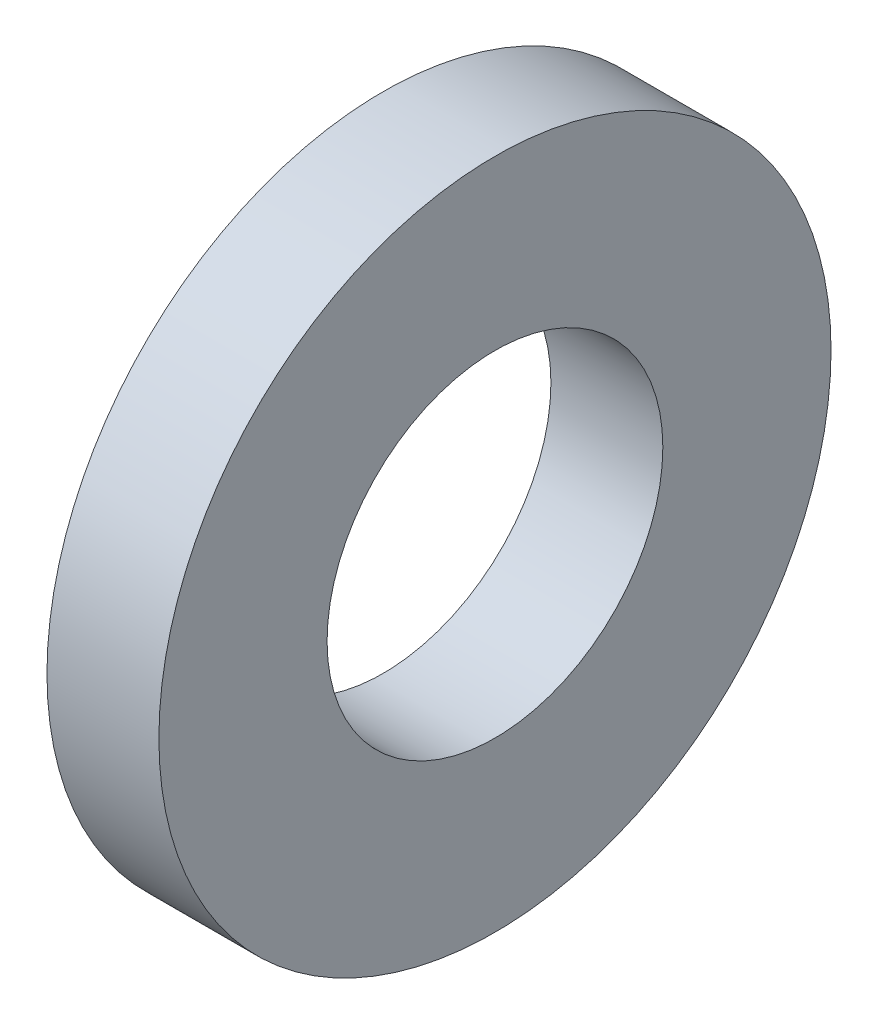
from build123d import *

# Parameters (mm, degrees)
SKETCH1_W = 4.4958
SKETCH1_H = 6.7564


with BuildPart() as part:
    # Sketch1 → Revolve1 (revolve)
    with BuildSketch(Plane.XY, mode=Mode.PRIVATE) as revolve1_sk:
        with Locations((-2.2479, 10.1219)):
            Rectangle(SKETCH1_W, SKETCH1_H)
    revolve(revolve1_sk.sketch.rotate(Axis((0, 0, 0), (-1, 0, 0)), 90), axis=Axis((0, 0, 0), (-1, 0, 0)))


solid = part.part
